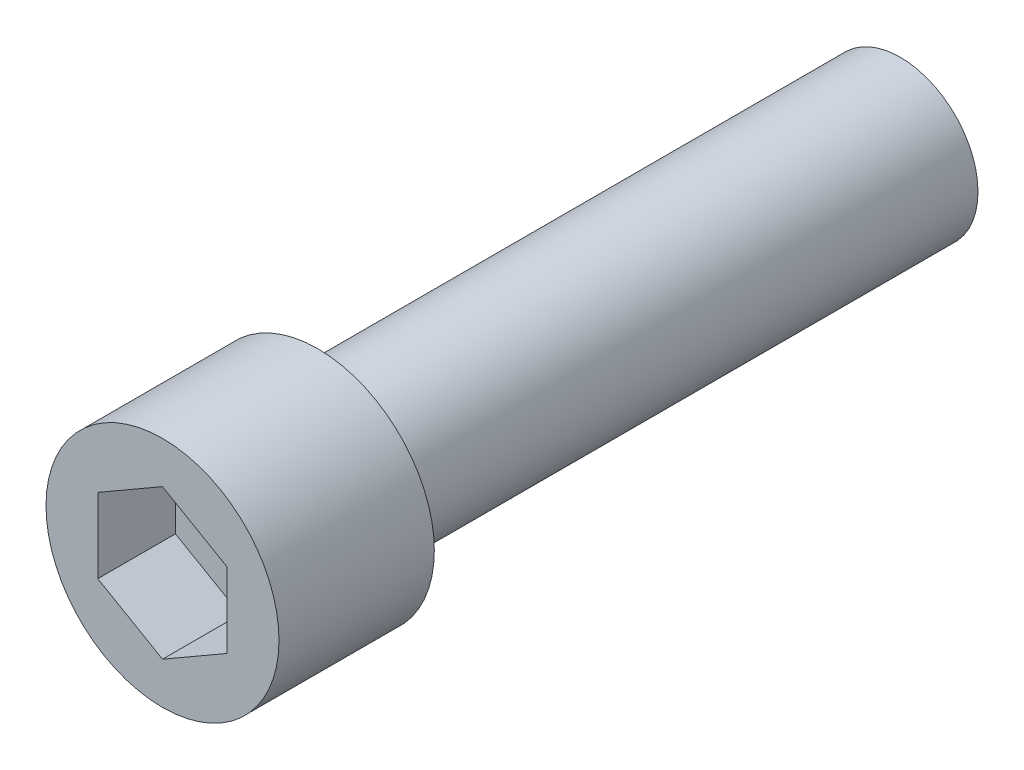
ISO-10303-21;
HEADER;
FILE_DESCRIPTION(('STEP AP214'),'2;1');
FILE_NAME('part.step','',(''),(''),'','','');
FILE_SCHEMA(('AUTOMOTIVE_DESIGN { 1 0 10303 214 1 1 1 1 }'));
ENDSEC;
DATA;
#1=APPLICATION_CONTEXT('core data for automotive mechanical design processes');
#2=APPLICATION_PROTOCOL_DEFINITION('international standard','automotive_design',2000,#1);
#3=PRODUCT_CONTEXT('',#1,'mechanical');
#4=PRODUCT('Part','Part','',(#3));
#5=PRODUCT_RELATED_PRODUCT_CATEGORY('part','',(#4));
#6=PRODUCT_DEFINITION_FORMATION('','',#4);
#7=PRODUCT_DEFINITION_CONTEXT('part definition',#1,'design');
#8=PRODUCT_DEFINITION('design','',#6,#7);
#9=PRODUCT_DEFINITION_SHAPE('','',#8);
#10=(LENGTH_UNIT() NAMED_UNIT(*) SI_UNIT(.MILLI.,.METRE.));
#11=(NAMED_UNIT(*) PLANE_ANGLE_UNIT() SI_UNIT($,.RADIAN.));
#12=(NAMED_UNIT(*) SI_UNIT($,.STERADIAN.) SOLID_ANGLE_UNIT());
#13=UNCERTAINTY_MEASURE_WITH_UNIT(LENGTH_MEASURE(1.E-05),#10,'distance_accuracy_value','');
#14=(GEOMETRIC_REPRESENTATION_CONTEXT(3) GLOBAL_UNCERTAINTY_ASSIGNED_CONTEXT((#13)) GLOBAL_UNIT_ASSIGNED_CONTEXT((#10,
#11,#12)) REPRESENTATION_CONTEXT('',''));
#15=CARTESIAN_POINT('',(0.,0.,0.));
#16=DIRECTION('',(0.,0.,1.));
#17=DIRECTION('',(1.,0.,0.));
#18=AXIS2_PLACEMENT_3D('',#15,#16,#17);
#19=CARTESIAN_POINT('',(0.,5.77350269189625,6.));
#20=DIRECTION('',(-0.5,-0.86602540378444,0.));
#21=DIRECTION('',(0.86602540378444,-0.5,0.));
#22=AXIS2_PLACEMENT_3D('',#19,#20,#21);
#23=PLANE('',#22);
#24=DIRECTION('',(0.,0.,1.));
#25=VECTOR('',#24,1.);
#26=CARTESIAN_POINT('',(5.,2.88675134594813,6.));
#27=LINE('',#26,#25);
#28=CARTESIAN_POINT('',(5.,2.88675134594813,6.));
#29=VERTEX_POINT('',#28);
#30=CARTESIAN_POINT('',(5.,2.88675134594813,12.));
#31=VERTEX_POINT('',#30);
#32=EDGE_CURVE('E64',#29,#31,#27,.T.);
#33=ORIENTED_EDGE('',*,*,#32,.T.);
#34=DIRECTION('',(0.86602540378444,-0.5,0.));
#35=VECTOR('',#34,1.);
#36=CARTESIAN_POINT('',(0.,5.77350269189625,12.));
#37=LINE('',#36,#35);
#38=CARTESIAN_POINT('',(0.,5.77350269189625,12.));
#39=VERTEX_POINT('',#38);
#40=EDGE_CURVE('E30',#39,#31,#37,.T.);
#41=ORIENTED_EDGE('',*,*,#40,.F.);
#42=DIRECTION('',(0.,0.,1.));
#43=VECTOR('',#42,1.);
#44=CARTESIAN_POINT('',(0.,5.77350269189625,6.));
#45=LINE('',#44,#43);
#46=CARTESIAN_POINT('',(0.,5.77350269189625,6.));
#47=VERTEX_POINT('',#46);
#48=EDGE_CURVE('E34',#47,#39,#45,.T.);
#49=ORIENTED_EDGE('',*,*,#48,.F.);
#50=DIRECTION('',(0.86602540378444,-0.5,0.));
#51=VECTOR('',#50,1.);
#52=CARTESIAN_POINT('',(0.,5.77350269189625,6.));
#53=LINE('',#52,#51);
#54=EDGE_CURVE('E66',#47,#29,#53,.T.);
#55=ORIENTED_EDGE('',*,*,#54,.T.);
#56=EDGE_LOOP('',(#33,#41,#49,#55));
#57=FACE_BOUND('',#56,.T.);
#58=ADVANCED_FACE('F15',(#57),#23,.T.);
#59=CARTESIAN_POINT('',(5.,-2.88675134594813,6.));
#60=DIRECTION('',(1.,0.,0.));
#61=DIRECTION('',(0.,0.,-1.));
#62=AXIS2_PLACEMENT_3D('',#59,#60,#61);
#63=PLANE('',#62);
#64=DIRECTION('',(0.,0.,1.));
#65=VECTOR('',#64,1.);
#66=CARTESIAN_POINT('',(5.,-2.88675134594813,6.));
#67=LINE('',#66,#65);
#68=CARTESIAN_POINT('',(5.,-2.88675134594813,6.));
#69=VERTEX_POINT('',#68);
#70=CARTESIAN_POINT('',(5.,-2.88675134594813,12.));
#71=VERTEX_POINT('',#70);
#72=EDGE_CURVE('E71',#69,#71,#67,.T.);
#73=ORIENTED_EDGE('',*,*,#72,.T.);
#74=DIRECTION('',(0.,1.,0.));
#75=VECTOR('',#74,1.);
#76=CARTESIAN_POINT('',(5.,-2.88675134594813,12.));
#77=LINE('',#76,#75);
#78=EDGE_CURVE('E74',#71,#31,#77,.T.);
#79=ORIENTED_EDGE('',*,*,#78,.T.);
#80=ORIENTED_EDGE('',*,*,#32,.F.);
#81=DIRECTION('',(0.,1.,0.));
#82=VECTOR('',#81,1.);
#83=CARTESIAN_POINT('',(5.,-2.88675134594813,6.));
#84=LINE('',#83,#82);
#85=EDGE_CURVE('E100',#69,#29,#84,.T.);
#86=ORIENTED_EDGE('',*,*,#85,.F.);
#87=EDGE_LOOP('',(#73,#79,#80,#86));
#88=FACE_BOUND('',#87,.T.);
#89=ADVANCED_FACE('F75',(#88),#63,.F.);
#90=CARTESIAN_POINT('',(0.,-5.77350269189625,6.));
#91=DIRECTION('',(0.5,-0.86602540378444,0.));
#92=DIRECTION('',(0.86602540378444,0.5,0.));
#93=AXIS2_PLACEMENT_3D('',#90,#91,#92);
#94=PLANE('',#93);
#95=DIRECTION('',(0.,0.,1.));
#96=VECTOR('',#95,1.);
#97=CARTESIAN_POINT('',(0.,-5.77350269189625,6.));
#98=LINE('',#97,#96);
#99=CARTESIAN_POINT('',(0.,-5.77350269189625,6.));
#100=VERTEX_POINT('',#99);
#101=CARTESIAN_POINT('',(0.,-5.77350269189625,12.));
#102=VERTEX_POINT('',#101);
#103=EDGE_CURVE('E108',#100,#102,#98,.T.);
#104=ORIENTED_EDGE('',*,*,#103,.T.);
#105=DIRECTION('',(0.86602540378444,0.5,0.));
#106=VECTOR('',#105,1.);
#107=CARTESIAN_POINT('',(0.,-5.77350269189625,12.));
#108=LINE('',#107,#106);
#109=EDGE_CURVE('E79',#102,#71,#108,.T.);
#110=ORIENTED_EDGE('',*,*,#109,.T.);
#111=ORIENTED_EDGE('',*,*,#72,.F.);
#112=DIRECTION('',(0.86602540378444,0.5,0.));
#113=VECTOR('',#112,1.);
#114=CARTESIAN_POINT('',(0.,-5.77350269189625,6.));
#115=LINE('',#114,#113);
#116=EDGE_CURVE('E97',#100,#69,#115,.T.);
#117=ORIENTED_EDGE('',*,*,#116,.F.);
#118=EDGE_LOOP('',(#104,#110,#111,#117));
#119=FACE_BOUND('',#118,.T.);
#120=ADVANCED_FACE('F141',(#119),#94,.F.);
#121=CARTESIAN_POINT('',(0.,-5.77350269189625,6.));
#122=DIRECTION('',(0.5,0.86602540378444,0.));
#123=DIRECTION('',(-0.86602540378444,0.5,0.));
#124=AXIS2_PLACEMENT_3D('',#121,#122,#123);
#125=PLANE('',#124);
#126=DIRECTION('',(0.,0.,1.));
#127=VECTOR('',#126,1.);
#128=CARTESIAN_POINT('',(-5.,-2.88675134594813,6.));
#129=LINE('',#128,#127);
#130=CARTESIAN_POINT('',(-5.,-2.88675134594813,6.));
#131=VERTEX_POINT('',#130);
#132=CARTESIAN_POINT('',(-5.,-2.88675134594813,12.));
#133=VERTEX_POINT('',#132);
#134=EDGE_CURVE('E106',#131,#133,#129,.T.);
#135=ORIENTED_EDGE('',*,*,#134,.T.);
#136=DIRECTION('',(-0.86602540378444,0.5,0.));
#137=VECTOR('',#136,1.);
#138=CARTESIAN_POINT('',(0.,-5.77350269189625,12.));
#139=LINE('',#138,#137);
#140=EDGE_CURVE('E249',#102,#133,#139,.T.);
#141=ORIENTED_EDGE('',*,*,#140,.F.);
#142=ORIENTED_EDGE('',*,*,#103,.F.);
#143=DIRECTION('',(-0.86602540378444,0.5,0.));
#144=VECTOR('',#143,1.);
#145=CARTESIAN_POINT('',(0.,-5.77350269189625,6.));
#146=LINE('',#145,#144);
#147=EDGE_CURVE('E94',#100,#131,#146,.T.);
#148=ORIENTED_EDGE('',*,*,#147,.T.);
#149=EDGE_LOOP('',(#135,#141,#142,#148));
#150=FACE_BOUND('',#149,.T.);
#151=ADVANCED_FACE('F153',(#150),#125,.T.);
#152=CARTESIAN_POINT('',(-5.,2.88675134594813,6.));
#153=DIRECTION('',(-1.,0.,0.));
#154=DIRECTION('',(0.,-1.,0.));
#155=AXIS2_PLACEMENT_3D('',#152,#153,#154);
#156=PLANE('',#155);
#157=DIRECTION('',(0.,0.,1.));
#158=VECTOR('',#157,1.);
#159=CARTESIAN_POINT('',(-5.,2.88675134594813,6.));
#160=LINE('',#159,#158);
#161=CARTESIAN_POINT('',(-5.,2.88675134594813,6.));
#162=VERTEX_POINT('',#161);
#163=CARTESIAN_POINT('',(-5.,2.88675134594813,12.));
#164=VERTEX_POINT('',#163);
#165=EDGE_CURVE('E104',#162,#164,#160,.T.);
#166=ORIENTED_EDGE('',*,*,#165,.T.);
#167=DIRECTION('',(0.,-1.,0.));
#168=VECTOR('',#167,1.);
#169=CARTESIAN_POINT('',(-5.,2.88675134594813,12.));
#170=LINE('',#169,#168);
#171=EDGE_CURVE('E250',#164,#133,#170,.T.);
#172=ORIENTED_EDGE('',*,*,#171,.T.);
#173=ORIENTED_EDGE('',*,*,#134,.F.);
#174=DIRECTION('',(0.,-1.,0.));
#175=VECTOR('',#174,1.);
#176=CARTESIAN_POINT('',(-5.,2.88675134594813,6.));
#177=LINE('',#176,#175);
#178=EDGE_CURVE('E91',#162,#131,#177,.T.);
#179=ORIENTED_EDGE('',*,*,#178,.F.);
#180=EDGE_LOOP('',(#166,#172,#173,#179));
#181=FACE_BOUND('',#180,.T.);
#182=ADVANCED_FACE('F149',(#181),#156,.F.);
#183=CARTESIAN_POINT('',(0.,5.77350269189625,6.));
#184=DIRECTION('',(-0.5,0.86602540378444,0.));
#185=DIRECTION('',(-0.86602540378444,-0.5,0.));
#186=AXIS2_PLACEMENT_3D('',#183,#184,#185);
#187=PLANE('',#186);
#188=DIRECTION('',(-0.86602540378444,-0.5,0.));
#189=VECTOR('',#188,1.);
#190=CARTESIAN_POINT('',(0.,5.77350269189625,6.));
#191=LINE('',#190,#189);
#192=EDGE_CURVE('E88',#47,#162,#191,.T.);
#193=ORIENTED_EDGE('',*,*,#192,.F.);
#194=ORIENTED_EDGE('',*,*,#48,.T.);
#195=DIRECTION('',(-0.86602540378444,-0.5,0.));
#196=VECTOR('',#195,1.);
#197=CARTESIAN_POINT('',(0.,5.77350269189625,12.));
#198=LINE('',#197,#196);
#199=EDGE_CURVE('E84',#39,#164,#198,.T.);
#200=ORIENTED_EDGE('',*,*,#199,.T.);
#201=ORIENTED_EDGE('',*,*,#165,.F.);
#202=EDGE_LOOP('',(#193,#194,#200,#201));
#203=FACE_BOUND('',#202,.T.);
#204=ADVANCED_FACE('F146',(#203),#187,.F.);
#205=CARTESIAN_POINT('',(-5.,8.66025403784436,6.));
#206=DIRECTION('',(0.,0.,-1.));
#207=DIRECTION('',(-1.,0.,0.));
#208=AXIS2_PLACEMENT_3D('',#205,#206,#207);
#209=PLANE('',#208);
#210=ORIENTED_EDGE('',*,*,#54,.F.);
#211=ORIENTED_EDGE('',*,*,#192,.T.);
#212=ORIENTED_EDGE('',*,*,#178,.T.);
#213=ORIENTED_EDGE('',*,*,#147,.F.);
#214=ORIENTED_EDGE('',*,*,#116,.T.);
#215=ORIENTED_EDGE('',*,*,#85,.T.);
#216=EDGE_LOOP('',(#210,#211,#212,#213,#214,#215));
#217=FACE_BOUND('',#216,.T.);
#218=ADVANCED_FACE('F145',(#217),#209,.F.);
#219=CARTESIAN_POINT('',(0.,0.,12.));
#220=DIRECTION('',(0.,0.,1.));
#221=DIRECTION('',(1.,0.,0.));
#222=AXIS2_PLACEMENT_3D('',#219,#220,#221);
#223=PLANE('',#222);
#224=CARTESIAN_POINT('',(0.,0.,12.));
#225=DIRECTION('',(0.,0.,1.));
#226=DIRECTION('',(1.,0.,0.));
#227=AXIS2_PLACEMENT_3D('',#224,#225,#226);
#228=CIRCLE('',#227,9.);
#229=CARTESIAN_POINT('',(9.,0.,12.));
#230=VERTEX_POINT('',#229);
#231=EDGE_CURVE('E9',#230,#230,#228,.T.);
#232=ORIENTED_EDGE('',*,*,#231,.T.);
#233=EDGE_LOOP('',(#232));
#234=FACE_BOUND('',#233,.T.);
#235=ORIENTED_EDGE('',*,*,#199,.F.);
#236=ORIENTED_EDGE('',*,*,#40,.T.);
#237=ORIENTED_EDGE('',*,*,#78,.F.);
#238=ORIENTED_EDGE('',*,*,#109,.F.);
#239=ORIENTED_EDGE('',*,*,#140,.T.);
#240=ORIENTED_EDGE('',*,*,#171,.F.);
#241=EDGE_LOOP('',(#235,#236,#237,#238,#239,#240));
#242=FACE_BOUND('',#241,.T.);
#243=ADVANCED_FACE('F17',(#234,#242),#223,.T.);
#244=CARTESIAN_POINT('',(0.,0.,-25.));
#245=DIRECTION('',(0.,0.,1.));
#246=DIRECTION('',(1.,0.,0.));
#247=AXIS2_PLACEMENT_3D('',#244,#245,#246);
#248=CYLINDRICAL_SURFACE('',#247,9.);
#249=CARTESIAN_POINT('',(0.,0.,0.));
#250=DIRECTION('',(0.,0.,1.));
#251=DIRECTION('',(1.,0.,0.));
#252=AXIS2_PLACEMENT_3D('',#249,#250,#251);
#253=CIRCLE('',#252,9.);
#254=CARTESIAN_POINT('',(9.,0.,0.));
#255=VERTEX_POINT('',#254);
#256=EDGE_CURVE('E23',#255,#255,#253,.T.);
#257=ORIENTED_EDGE('',*,*,#256,.T.);
#258=EDGE_LOOP('',(#257));
#259=FACE_BOUND('',#258,.T.);
#260=ORIENTED_EDGE('',*,*,#231,.F.);
#261=EDGE_LOOP('',(#260));
#262=FACE_BOUND('',#261,.T.);
#263=ADVANCED_FACE('F118',(#259,#262),#248,.T.);
#264=CARTESIAN_POINT('',(9.,0.,0.));
#265=DIRECTION('',(0.,0.,-1.));
#266=DIRECTION('',(-1.,0.,0.));
#267=AXIS2_PLACEMENT_3D('',#264,#265,#266);
#268=PLANE('',#267);
#269=CARTESIAN_POINT('',(0.,0.,0.));
#270=DIRECTION('',(0.,0.,1.));
#271=DIRECTION('',(1.,0.,0.));
#272=AXIS2_PLACEMENT_3D('',#269,#270,#271);
#273=CIRCLE('',#272,6.);
#274=CARTESIAN_POINT('',(6.,0.,0.));
#275=VERTEX_POINT('',#274);
#276=EDGE_CURVE('E113',#275,#275,#273,.T.);
#277=ORIENTED_EDGE('',*,*,#276,.T.);
#278=EDGE_LOOP('',(#277));
#279=FACE_BOUND('',#278,.T.);
#280=ORIENTED_EDGE('',*,*,#256,.F.);
#281=EDGE_LOOP('',(#280));
#282=FACE_BOUND('',#281,.T.);
#283=ADVANCED_FACE('F121',(#279,#282),#268,.T.);
#284=CARTESIAN_POINT('',(0.,0.,-25.));
#285=DIRECTION('',(0.,0.,1.));
#286=DIRECTION('',(1.,0.,0.));
#287=AXIS2_PLACEMENT_3D('',#284,#285,#286);
#288=CYLINDRICAL_SURFACE('',#287,6.);
#289=CARTESIAN_POINT('',(0.,0.,-45.));
#290=DIRECTION('',(0.,0.,1.));
#291=DIRECTION('',(1.,0.,0.));
#292=AXIS2_PLACEMENT_3D('',#289,#290,#291);
#293=CIRCLE('',#292,6.);
#294=CARTESIAN_POINT('',(6.,0.,-45.));
#295=VERTEX_POINT('',#294);
#296=EDGE_CURVE('E70',#295,#295,#293,.T.);
#297=ORIENTED_EDGE('',*,*,#296,.T.);
#298=EDGE_LOOP('',(#297));
#299=FACE_BOUND('',#298,.T.);
#300=ORIENTED_EDGE('',*,*,#276,.F.);
#301=EDGE_LOOP('',(#300));
#302=FACE_BOUND('',#301,.T.);
#303=ADVANCED_FACE('F123',(#299,#302),#288,.T.);
#304=CARTESIAN_POINT('',(6.,0.,-45.));
#305=DIRECTION('',(0.,0.,-1.));
#306=DIRECTION('',(-1.,0.,0.));
#307=AXIS2_PLACEMENT_3D('',#304,#305,#306);
#308=PLANE('',#307);
#309=ORIENTED_EDGE('',*,*,#296,.F.);
#310=EDGE_LOOP('',(#309));
#311=FACE_BOUND('',#310,.T.);
#312=ADVANCED_FACE('F132',(#311),#308,.T.);
#313=CLOSED_SHELL('',(#58,#89,#120,#151,#182,#204,#218,#243,#263,#283,#303,#312));
#314=MANIFOLD_SOLID_BREP('B1',#313);
#315=ADVANCED_BREP_SHAPE_REPRESENTATION('',(#18,#314),#14);
#316=SHAPE_DEFINITION_REPRESENTATION(#9,#315);
ENDSEC;
END-ISO-10303-21;
